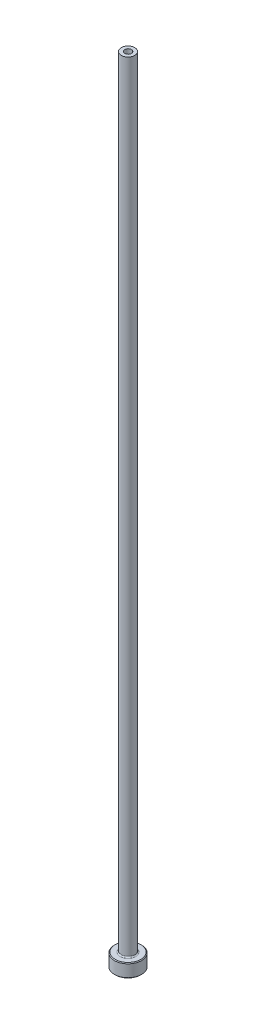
ISO-10303-21;
HEADER;
FILE_DESCRIPTION(('STEP AP214'),'2;1');
FILE_NAME('part.step','',(''),(''),'','','');
FILE_SCHEMA(('AUTOMOTIVE_DESIGN { 1 0 10303 214 1 1 1 1 }'));
ENDSEC;
DATA;
#1=APPLICATION_CONTEXT('core data for automotive mechanical design processes');
#2=APPLICATION_PROTOCOL_DEFINITION('international standard','automotive_design',2000,#1);
#3=PRODUCT_CONTEXT('',#1,'mechanical');
#4=PRODUCT('Part','Part','',(#3));
#5=PRODUCT_RELATED_PRODUCT_CATEGORY('part','',(#4));
#6=PRODUCT_DEFINITION_FORMATION('','',#4);
#7=PRODUCT_DEFINITION_CONTEXT('part definition',#1,'design');
#8=PRODUCT_DEFINITION('design','',#6,#7);
#9=PRODUCT_DEFINITION_SHAPE('','',#8);
#10=(LENGTH_UNIT() NAMED_UNIT(*) SI_UNIT(.MILLI.,.METRE.));
#11=(NAMED_UNIT(*) PLANE_ANGLE_UNIT() SI_UNIT($,.RADIAN.));
#12=(NAMED_UNIT(*) SI_UNIT($,.STERADIAN.) SOLID_ANGLE_UNIT());
#13=UNCERTAINTY_MEASURE_WITH_UNIT(LENGTH_MEASURE(1.E-05),#10,'distance_accuracy_value','');
#14=(GEOMETRIC_REPRESENTATION_CONTEXT(3) GLOBAL_UNCERTAINTY_ASSIGNED_CONTEXT((#13)) GLOBAL_UNIT_ASSIGNED_CONTEXT((#10,
#11,#12)) REPRESENTATION_CONTEXT('',''));
#15=CARTESIAN_POINT('',(0.,0.,0.));
#16=DIRECTION('',(0.,0.,1.));
#17=DIRECTION('',(1.,0.,0.));
#18=AXIS2_PLACEMENT_3D('',#15,#16,#17);
#19=CARTESIAN_POINT('',(0.,0.,0.));
#20=DIRECTION('',(0.,-1.,0.));
#21=DIRECTION('',(0.,0.,-1.));
#22=AXIS2_PLACEMENT_3D('',#19,#20,#21);
#23=PLANE('',#22);
#24=CARTESIAN_POINT('',(0.,0.,0.));
#25=DIRECTION('',(0.,-1.,0.));
#26=DIRECTION('',(0.,0.,-1.));
#27=AXIS2_PLACEMENT_3D('',#24,#25,#26);
#28=CIRCLE('',#27,4.50850000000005);
#29=CARTESIAN_POINT('',(0.,0.,-4.50850000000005));
#30=VERTEX_POINT('',#29);
#31=EDGE_CURVE('E44',#30,#30,#28,.T.);
#32=ORIENTED_EDGE('',*,*,#31,.T.);
#33=EDGE_LOOP('',(#32));
#34=FACE_BOUND('',#33,.T.);
#35=CARTESIAN_POINT('',(0.,0.,0.));
#36=DIRECTION('',(0.,-1.,0.));
#37=DIRECTION('',(0.,0.,-1.));
#38=AXIS2_PLACEMENT_3D('',#35,#36,#37);
#39=CIRCLE('',#38,1.777365);
#40=CARTESIAN_POINT('',(0.,0.,-1.777365));
#41=VERTEX_POINT('',#40);
#42=EDGE_CURVE('E58',#41,#41,#39,.T.);
#43=ORIENTED_EDGE('',*,*,#42,.F.);
#44=EDGE_LOOP('',(#43));
#45=FACE_BOUND('',#44,.T.);
#46=ADVANCED_FACE('F29',(#34,#45),#23,.T.);
#47=CARTESIAN_POINT('',(0.,0.,0.));
#48=DIRECTION('',(0.,-1.,0.));
#49=DIRECTION('',(0.,0.,-1.));
#50=AXIS2_PLACEMENT_3D('',#47,#48,#49);
#51=CYLINDRICAL_SURFACE('',#50,4.7625);
#52=CARTESIAN_POINT('',(0.,0.253999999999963,0.));
#53=DIRECTION('',(0.,-1.,0.));
#54=DIRECTION('',(0.,0.,-1.));
#55=AXIS2_PLACEMENT_3D('',#52,#53,#54);
#56=CIRCLE('',#55,4.7625);
#57=CARTESIAN_POINT('',(0.,0.253999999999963,-4.7625));
#58=VERTEX_POINT('',#57);
#59=EDGE_CURVE('E36',#58,#58,#56,.F.);
#60=ORIENTED_EDGE('',*,*,#59,.T.);
#61=EDGE_LOOP('',(#60));
#62=FACE_BOUND('',#61,.T.);
#63=CARTESIAN_POINT('',(0.,4.49579999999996,0.));
#64=DIRECTION('',(0.,1.,0.));
#65=DIRECTION('',(0.,0.,1.));
#66=AXIS2_PLACEMENT_3D('',#63,#64,#65);
#67=CIRCLE('',#66,4.7625);
#68=CARTESIAN_POINT('',(0.,4.49579999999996,4.7625));
#69=VERTEX_POINT('',#68);
#70=EDGE_CURVE('E40',#69,#69,#67,.F.);
#71=ORIENTED_EDGE('',*,*,#70,.T.);
#72=EDGE_LOOP('',(#71));
#73=FACE_BOUND('',#72,.T.);
#74=ADVANCED_FACE('F103',(#62,#73),#51,.T.);
#75=CARTESIAN_POINT('',(4.7625,4.7498,0.));
#76=DIRECTION('',(0.,1.,0.));
#77=DIRECTION('',(0.,0.,1.));
#78=AXIS2_PLACEMENT_3D('',#75,#76,#77);
#79=PLANE('',#78);
#80=CARTESIAN_POINT('',(0.,4.7498,0.));
#81=DIRECTION('',(0.,1.,0.));
#82=DIRECTION('',(0.,0.,1.));
#83=AXIS2_PLACEMENT_3D('',#80,#81,#82);
#84=CIRCLE('',#83,4.50849999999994);
#85=CARTESIAN_POINT('',(0.,4.7498,4.50849999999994));
#86=VERTEX_POINT('',#85);
#87=EDGE_CURVE('E10',#86,#86,#84,.T.);
#88=ORIENTED_EDGE('',*,*,#87,.T.);
#89=EDGE_LOOP('',(#88));
#90=FACE_BOUND('',#89,.T.);
#91=CARTESIAN_POINT('',(0.,4.7498,0.));
#92=DIRECTION('',(0.,-1.,0.));
#93=DIRECTION('',(0.,0.,-1.));
#94=AXIS2_PLACEMENT_3D('',#91,#92,#93);
#95=CIRCLE('',#94,2.771775);
#96=CARTESIAN_POINT('',(0.,4.7498,-2.771775));
#97=VERTEX_POINT('',#96);
#98=EDGE_CURVE('E49',#97,#97,#95,.T.);
#99=ORIENTED_EDGE('',*,*,#98,.T.);
#100=EDGE_LOOP('',(#99));
#101=FACE_BOUND('',#100,.T.);
#102=ADVANCED_FACE('F109',(#90,#101),#79,.T.);
#103=CARTESIAN_POINT('',(0.,5.146675,0.));
#104=DIRECTION('',(0.,-1.,0.));
#105=DIRECTION('',(0.,0.,-1.));
#106=AXIS2_PLACEMENT_3D('',#103,#104,#105);
#107=TOROIDAL_SURFACE('',#106,2.771775,0.396875);
#108=CARTESIAN_POINT('',(0.,5.146675,0.));
#109=DIRECTION('',(0.,-1.,0.));
#110=DIRECTION('',(0.,0.,-1.));
#111=AXIS2_PLACEMENT_3D('',#108,#109,#110);
#112=CIRCLE('',#111,2.3749);
#113=CARTESIAN_POINT('',(0.,5.146675,-2.3749));
#114=VERTEX_POINT('',#113);
#115=EDGE_CURVE('E52',#114,#114,#112,.T.);
#116=ORIENTED_EDGE('',*,*,#115,.T.);
#117=EDGE_LOOP('',(#116));
#118=FACE_BOUND('',#117,.T.);
#119=ORIENTED_EDGE('',*,*,#98,.F.);
#120=EDGE_LOOP('',(#119));
#121=FACE_BOUND('',#120,.T.);
#122=ADVANCED_FACE('F139',(#118,#121),#107,.F.);
#123=CARTESIAN_POINT('',(0.,0.,0.));
#124=DIRECTION('',(0.,-1.,0.));
#125=DIRECTION('',(0.,0.,-1.));
#126=AXIS2_PLACEMENT_3D('',#123,#124,#125);
#127=CYLINDRICAL_SURFACE('',#126,2.3749);
#128=CARTESIAN_POINT('',(0.,279.4,0.));
#129=DIRECTION('',(0.,-1.,0.));
#130=DIRECTION('',(0.,0.,-1.));
#131=AXIS2_PLACEMENT_3D('',#128,#129,#130);
#132=CIRCLE('',#131,2.3749);
#133=CARTESIAN_POINT('',(0.,279.4,-2.3749));
#134=VERTEX_POINT('',#133);
#135=EDGE_CURVE('E55',#134,#134,#132,.T.);
#136=ORIENTED_EDGE('',*,*,#135,.T.);
#137=EDGE_LOOP('',(#136));
#138=FACE_BOUND('',#137,.T.);
#139=ORIENTED_EDGE('',*,*,#115,.F.);
#140=EDGE_LOOP('',(#139));
#141=FACE_BOUND('',#140,.T.);
#142=ADVANCED_FACE('F182',(#138,#141),#127,.T.);
#143=CARTESIAN_POINT('',(2.3749,279.4,0.));
#144=DIRECTION('',(0.,1.,0.));
#145=DIRECTION('',(0.,0.,1.));
#146=AXIS2_PLACEMENT_3D('',#143,#144,#145);
#147=PLANE('',#146);
#148=CARTESIAN_POINT('',(0.,279.4,0.));
#149=DIRECTION('',(0.,-1.,0.));
#150=DIRECTION('',(0.,0.,-1.));
#151=AXIS2_PLACEMENT_3D('',#148,#149,#150);
#152=CIRCLE('',#151,1.18999);
#153=CARTESIAN_POINT('',(0.,279.4,-1.18999));
#154=VERTEX_POINT('',#153);
#155=EDGE_CURVE('E70',#154,#154,#152,.T.);
#156=ORIENTED_EDGE('',*,*,#155,.T.);
#157=EDGE_LOOP('',(#156));
#158=FACE_BOUND('',#157,.T.);
#159=ORIENTED_EDGE('',*,*,#135,.F.);
#160=EDGE_LOOP('',(#159));
#161=FACE_BOUND('',#160,.T.);
#162=ADVANCED_FACE('F74',(#158,#161),#147,.T.);
#163=CARTESIAN_POINT('',(0.,0.,0.));
#164=DIRECTION('',(0.,-1.,0.));
#165=DIRECTION('',(0.,0.,-1.));
#166=AXIS2_PLACEMENT_3D('',#163,#164,#165);
#167=CONICAL_SURFACE('',#166,1.777365,0.785398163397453);
#168=CARTESIAN_POINT('',(0.,0.396875,0.));
#169=DIRECTION('',(0.,-1.,0.));
#170=DIRECTION('',(0.,0.,-1.));
#171=AXIS2_PLACEMENT_3D('',#168,#169,#170);
#172=CIRCLE('',#171,1.38049);
#173=CARTESIAN_POINT('',(0.,0.396875,-1.38049));
#174=VERTEX_POINT('',#173);
#175=EDGE_CURVE('E61',#174,#174,#172,.T.);
#176=ORIENTED_EDGE('',*,*,#175,.F.);
#177=EDGE_LOOP('',(#176));
#178=FACE_BOUND('',#177,.T.);
#179=ORIENTED_EDGE('',*,*,#42,.T.);
#180=EDGE_LOOP('',(#179));
#181=FACE_BOUND('',#180,.T.);
#182=ADVANCED_FACE('F93',(#178,#181),#167,.F.);
#183=CARTESIAN_POINT('',(0.,0.,0.));
#184=DIRECTION('',(0.,-1.,0.));
#185=DIRECTION('',(0.,0.,-1.));
#186=AXIS2_PLACEMENT_3D('',#183,#184,#185);
#187=CYLINDRICAL_SURFACE('',#186,1.38049);
#188=CARTESIAN_POINT('',(0.,217.6145,0.));
#189=DIRECTION('',(0.,-1.,0.));
#190=DIRECTION('',(0.,0.,-1.));
#191=AXIS2_PLACEMENT_3D('',#188,#189,#190);
#192=CIRCLE('',#191,1.38049);
#193=CARTESIAN_POINT('',(0.,217.6145,-1.38049));
#194=VERTEX_POINT('',#193);
#195=EDGE_CURVE('E64',#194,#194,#192,.T.);
#196=ORIENTED_EDGE('',*,*,#195,.F.);
#197=EDGE_LOOP('',(#196));
#198=FACE_BOUND('',#197,.T.);
#199=ORIENTED_EDGE('',*,*,#175,.T.);
#200=EDGE_LOOP('',(#199));
#201=FACE_BOUND('',#200,.T.);
#202=ADVANCED_FACE('F87',(#198,#201),#187,.F.);
#203=CARTESIAN_POINT('',(0.,217.6145,0.));
#204=DIRECTION('',(0.,-1.,0.));
#205=DIRECTION('',(0.,0.,-1.));
#206=AXIS2_PLACEMENT_3D('',#203,#204,#205);
#207=CONICAL_SURFACE('',#206,1.38049,0.0133325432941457);
#208=CARTESIAN_POINT('',(0.,231.902,0.));
#209=DIRECTION('',(0.,-1.,0.));
#210=DIRECTION('',(0.,0.,-1.));
#211=AXIS2_PLACEMENT_3D('',#208,#209,#210);
#212=CIRCLE('',#211,1.18999);
#213=CARTESIAN_POINT('',(0.,231.902,-1.18999));
#214=VERTEX_POINT('',#213);
#215=EDGE_CURVE('E67',#214,#214,#212,.T.);
#216=ORIENTED_EDGE('',*,*,#215,.F.);
#217=EDGE_LOOP('',(#216));
#218=FACE_BOUND('',#217,.T.);
#219=ORIENTED_EDGE('',*,*,#195,.T.);
#220=EDGE_LOOP('',(#219));
#221=FACE_BOUND('',#220,.T.);
#222=ADVANCED_FACE('F81',(#218,#221),#207,.F.);
#223=CARTESIAN_POINT('',(0.,0.,0.));
#224=DIRECTION('',(0.,-1.,0.));
#225=DIRECTION('',(0.,0.,-1.));
#226=AXIS2_PLACEMENT_3D('',#223,#224,#225);
#227=CYLINDRICAL_SURFACE('',#226,1.18999);
#228=ORIENTED_EDGE('',*,*,#155,.F.);
#229=EDGE_LOOP('',(#228));
#230=FACE_BOUND('',#229,.T.);
#231=ORIENTED_EDGE('',*,*,#215,.T.);
#232=EDGE_LOOP('',(#231));
#233=FACE_BOUND('',#232,.T.);
#234=ADVANCED_FACE('F77',(#230,#233),#227,.F.);
#235=CARTESIAN_POINT('',(0.,0.,0.));
#236=DIRECTION('',(0.,1.,0.));
#237=DIRECTION('',(0.,0.,1.));
#238=AXIS2_PLACEMENT_3D('',#235,#236,#237);
#239=CONICAL_SURFACE('',#238,4.50850000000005,0.785398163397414);
#240=ORIENTED_EDGE('',*,*,#59,.F.);
#241=EDGE_LOOP('',(#240));
#242=FACE_BOUND('',#241,.T.);
#243=ORIENTED_EDGE('',*,*,#31,.F.);
#244=EDGE_LOOP('',(#243));
#245=FACE_BOUND('',#244,.T.);
#246=ADVANCED_FACE('F80',(#242,#245),#239,.T.);
#247=CARTESIAN_POINT('',(0.,4.49579999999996,0.));
#248=DIRECTION('',(0.,-1.,0.));
#249=DIRECTION('',(0.,0.,-1.));
#250=AXIS2_PLACEMENT_3D('',#247,#248,#249);
#251=CONICAL_SURFACE('',#250,4.7625,0.785398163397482);
#252=ORIENTED_EDGE('',*,*,#87,.F.);
#253=EDGE_LOOP('',(#252));
#254=FACE_BOUND('',#253,.T.);
#255=ORIENTED_EDGE('',*,*,#70,.F.);
#256=EDGE_LOOP('',(#255));
#257=FACE_BOUND('',#256,.T.);
#258=ADVANCED_FACE('F31',(#254,#257),#251,.T.);
#259=CLOSED_SHELL('',(#46,#74,#102,#122,#142,#162,#182,#202,#222,#234,#246,#258));
#260=MANIFOLD_SOLID_BREP('B2',#259);
#261=ADVANCED_BREP_SHAPE_REPRESENTATION('',(#18,#260),#14);
#262=SHAPE_DEFINITION_REPRESENTATION(#9,#261);
ENDSEC;
END-ISO-10303-21;
